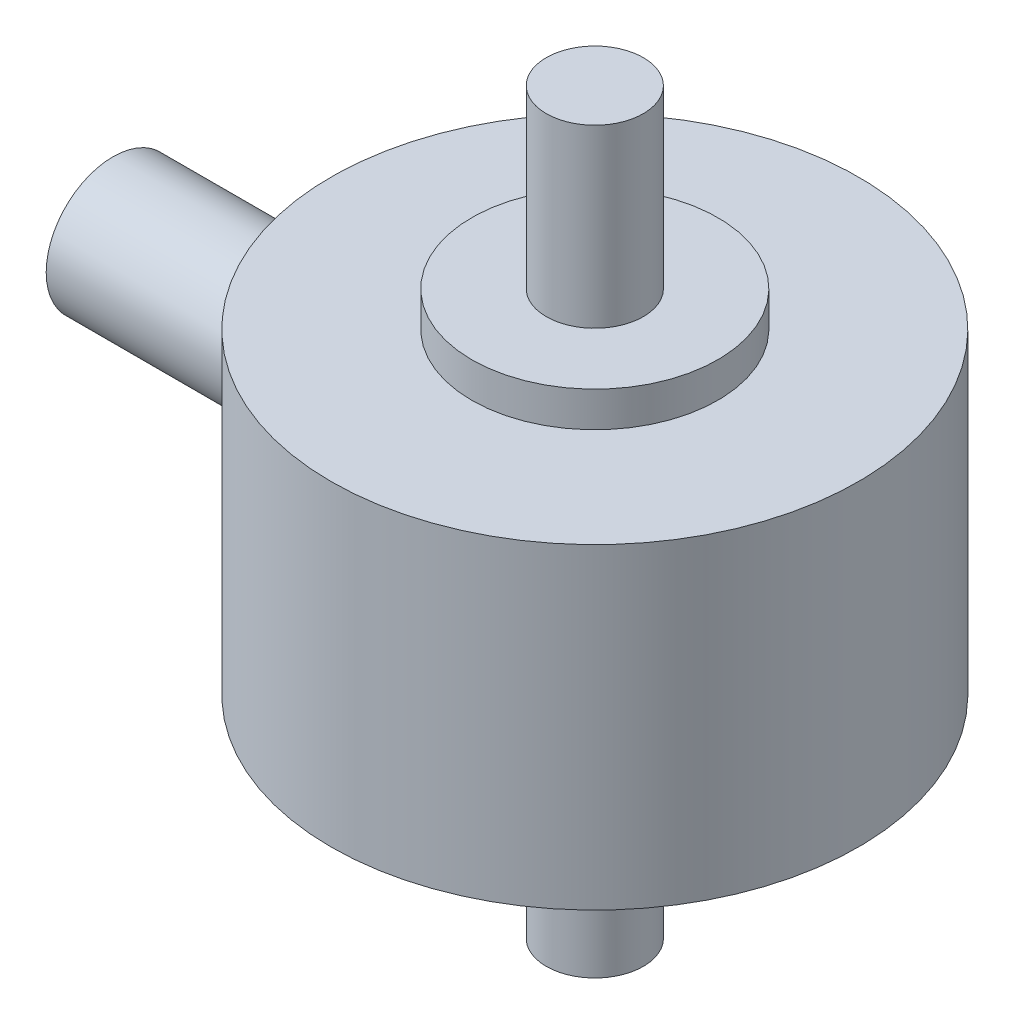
from build123d import *
from build123d.topology import SkipClean

# Parameters (mm, degrees)
SKETCH1_R                       = 9.525
EXTRUDE1_DEPTH                  = 5.715
SKETCH2_R                       = 4.445
EXTRUDE2_DEPTH                  = 1.27
SKETCH3_R                       = 1.7526
EXTRUDE3_DEPTH                  = 6.35
SKETCH4_R                       = 2.413
EXTRUDE4_DEPTH                  = 7.874
EXTRUDE4_DIRECTION_2_REACH      = 27.129
EXTRUDE4_DIRECTION_2_END_RADIUS = 9.525


with BuildPart() as part:
    # Sketch1 → Extrude1 (new body)
    with BuildSketch(Plane(origin=(0, 0, 0), x_dir=(1, 0, 0), z_dir=(0, 1, 0))):
        with Locations(Location((0, 0, 0), (0, 0, 270))):
            Circle(SKETCH1_R)
    extrude1 = extrude(amount=EXTRUDE1_DEPTH)

    # Sketch2 → Extrude2 (add)
    with BuildSketch(Plane(origin=(0, 5.715, 0), x_dir=(-1, 0, 0), z_dir=(0, 1, 0))):
        with Locations(Location((0, 0, 0), (0, 0, 90))):
            Circle(SKETCH2_R)
    extrude2 = extrude(amount=EXTRUDE2_DEPTH)

    # Sketch3 → Extrude3 (add)
    with BuildSketch(Plane(origin=(0, 6.985, 0), x_dir=(-1, 0, 0), z_dir=(0, 1, 0))):
        with Locations(Location((0, 0, 0), (0, 0, 90))):
            Circle(SKETCH3_R)
    extrude3 = extrude(amount=EXTRUDE3_DEPTH)

    # Mirror1: Extrude1, Extrude2, Extrude3 across plane
    add(extrude1.mirror(Plane.ZX))
    add(extrude2.mirror(Plane.ZX))
    add(extrude3.mirror(Plane.ZX))

    # Sketch4 → Extrude4 (add)
    with BuildSketch(Plane(origin=(-9.525, 0, 0), x_dir=(0, 0, -1), z_dir=(-1, 0, 0))):
        Circle(SKETCH4_R)
    extrude(amount=EXTRUDE4_DEPTH)

    # Extrude4 direction 2: up to this cylinder (the profile starts outside it)
    with SkipClean():  # the faces are left unmerged after this step: merging them gives an invalid solid
        extrude4_direction_2_end = Plane(origin=(0, 0, 0), z_dir=(0, -1, 0)) * Cylinder(EXTRUDE4_DIRECTION_2_END_RADIUS, 74.308, mode=Mode.PRIVATE)
        # Sketch4 → Extrude4 direction 2 (add, up to the surface)
        with BuildSketch(Plane(origin=(-9.525, 0, 0), x_dir=(0, 0, -1), z_dir=(-1, 0, 0)), mode=Mode.PRIVATE) as extrude4_direction_2_sk1:
            Circle(SKETCH4_R)
        extrude4_direction_2_tool1 = extrude(extrude4_direction_2_sk1.sketch, amount=-EXTRUDE4_DIRECTION_2_REACH, mode=Mode.PRIVATE) - extrude4_direction_2_end
        add(extrude4_direction_2_tool1.solids().sort_by_distance((-9.525, 0, 0))[0])
        add(extrude4_direction_2_tool1.solids().sort_by_distance((-9.525, 0, 0))[1])


solid = part.part
